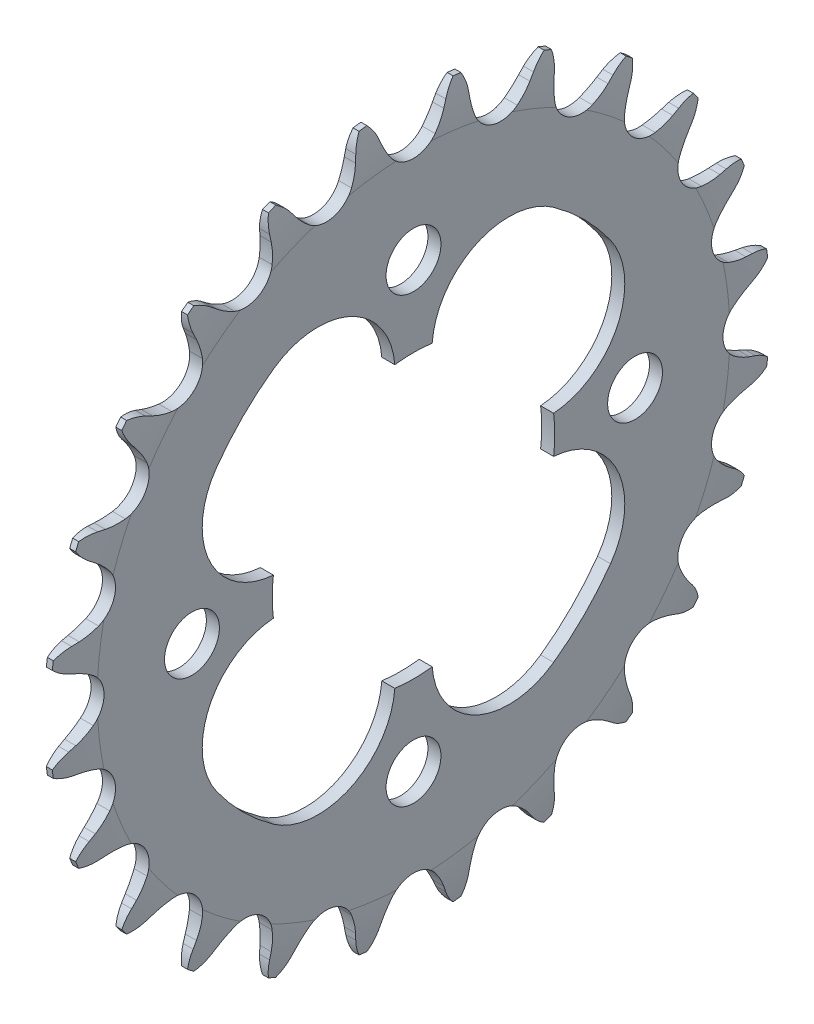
from build123d import *

# Parameters (mm, degrees)
TOOTHCUT_DEPTH    = 2.54
TEETHCUTS_COUNT   = 24
TEETHCUTS_ANGLE   = 345
BORSKE_R          = 3.9624
BORE_DEPTH        = 50.8000508
CIRPATTERN1_COUNT = 4


with BuildPart() as part:
    # BasProSke → Base-Revolve (revolve)
    with BuildSketch(Plane(origin=(0, 0, 0), x_dir=(1, 0, 0), z_dir=(0, 1, 0)), mode=Mode.PRIVATE) as base_revolve_sk:
        with BuildLine():
            Line((-0.9398, 0), (-0.9398, 45.693038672))
            ThreePointArc((-0.9398, 45.693038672), (-0.812597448, 48.878182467), (-0.4318, 52.043038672))
            Line((-0.4318, 52.043038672), (0.4318, 52.043038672))
            ThreePointArc((0.4318, 52.043038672), (0.812597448, 48.878182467), (0.9398, 45.693038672))
            Line((0.9398, 45.693038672), (0.9398, 0))
            Line((0.9398, 0), (-0.9398, 0))
        make_face()
    revolve(base_revolve_sk.sketch.rotate(Axis((-10, 0, 0), (1, 0, 0)), 180), axis=Axis((-10, 0, 0), (1, 0, 0)))

    # TooCutSke → ToothCut (cut, symmetric)
    with BuildSketch(Plane(origin=(0, 0, 0), x_dir=(0, 0, -1), z_dir=(1, 0, 0))):
        with BuildLine():
            Line((4.499744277, 48.655270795), (4.877130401, 49.597213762))
            ThreePointArc((4.877130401, 49.597213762), (7.219703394, 52.502989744), (10.788268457, 53.596847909))
            ThreePointArc((10.788268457, 53.596847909), (0, 54.671828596), (-10.788268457, 53.596847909))
            ThreePointArc((-10.788268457, 53.596847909), (-7.219703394, 52.502989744), (-4.877130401, 49.597213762))
            Line((-4.877130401, 49.597213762), (-4.499744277, 48.655270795))
            ThreePointArc((-4.499744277, 48.655270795), (-3.896650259, 47.404927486), (-3.128772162, 46.248448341))
            ThreePointArc((-3.128772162, 46.248448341), (0, 44.70550866), (3.128772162, 46.248448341))
            ThreePointArc((3.128772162, 46.248448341), (3.896650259, 47.404927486), (4.499744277, 48.655270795))
        make_face()
    toothcut = extrude(amount=TOOTHCUT_DEPTH, both=True, mode=Mode.SUBTRACT)

    # TeethCuts: ToothCut ×24 about axis
    teethcuts_axis = Axis((-10, 0, 0), (1, 0, 0))
    for i in range(1, TEETHCUTS_COUNT):
        add(toothcut.rotate(teethcuts_axis, i * TEETHCUTS_ANGLE / (TEETHCUTS_COUNT - 1)), mode=Mode.SUBTRACT)

    # BorSke → Bore (cut, symmetric)
    with BuildSketch(Plane(origin=(0, 0, 0), x_dir=(0, 0, -1), z_dir=(1, 0, 0))):
        with Locations(Location((0, 32.004, 0), (0, 0, 180))):
            Circle(BORSKE_R)
        with BuildLine():
            ThreePointArc((2.699331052, 20.242414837), (-14.440251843, -14.440251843), (20.242414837, 2.699331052))
            ThreePointArc((20.242414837, 2.699331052), (29.469764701, 9.071202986), (28.46259298, 20.239476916))
            ThreePointArc((28.46259298, 20.239476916), (24.695704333, 24.695704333), (20.239476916, 28.46259298))
            ThreePointArc((20.239476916, 28.46259298), (9.071202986, 29.469764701), (2.699331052, 20.242414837))
        make_face()
    bore = extrude(amount=BORE_DEPTH, both=True, mode=Mode.SUBTRACT)

    # CirPattern1: Bore ×4 about axis
    cirpattern1_axis = Axis((0, 0, 0), (1, 0, 0))
    for i in range(1, CIRPATTERN1_COUNT):
        add(bore.rotate(cirpattern1_axis, i * 360 / CIRPATTERN1_COUNT), mode=Mode.SUBTRACT)


solid = part.part
